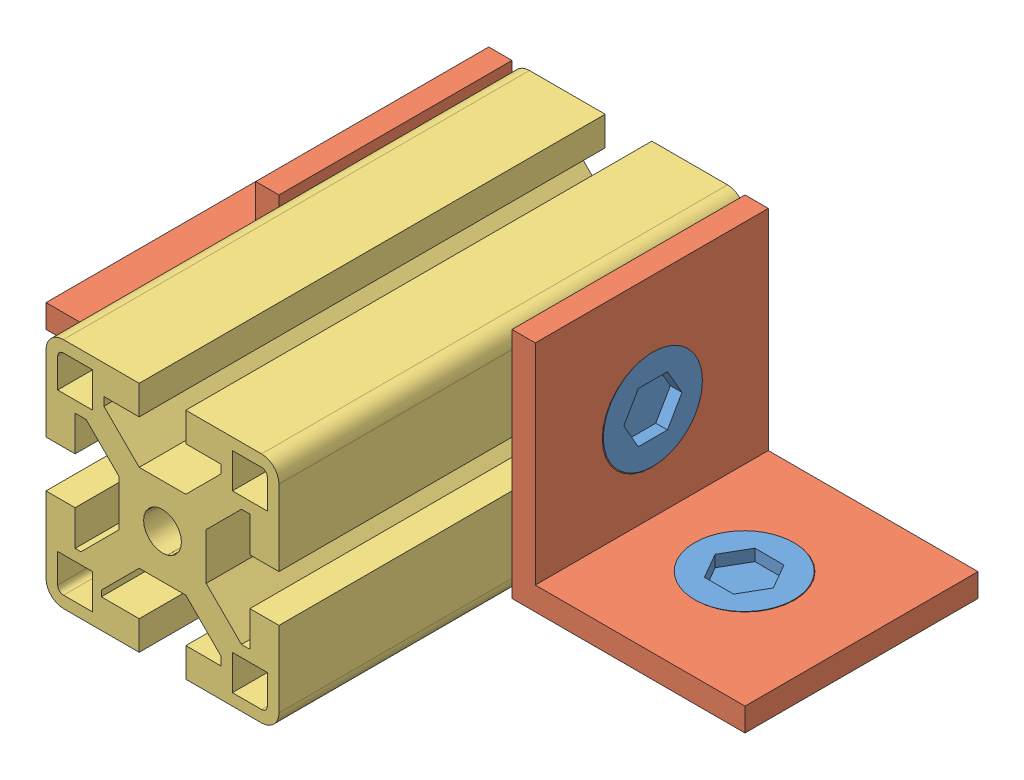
SolidWorks assembly X- Soporte motor.SLDASM, configuration Predeterminado (file format 3800). Lengths in mm.
Overall size (120 55.89 80).
9 component instances, 3 part files, 0 mates.
Components (placement in the parent):
- X-Angulo con tornillos-1: X-Angulo con tornillos.SLDASM [Predeterminado] at (20 -20 0) size (55.92 55.89 40)
  - X-Tornillos abellanados  M8 x16-1: X-Tornillos abellanados  M8 x16.SLDPRT [Predeterminado] at (19.9756 -15.8873 20.1118) size (17 20 17)
  - X-Angulo 40x40 L (0.0.196.87)-1: X-Angulo 40x40 L (0.0.196.87).SLDPRT [Predeterminado] at origin size (40 40 40)
  - X-Tornillos abellanados  M8 x16-2: X-Tornillos abellanados  M8 x16.SLDPRT [Predeterminado] at (-15.9177 20.1326 19.8969) x (0 0 1) z (0 1 0) size (17 20 17)
- X-Pervil AL estructura 4x4x80-2: X-Pervil AL estructura 4x4x80.SLDPRT [Predeterminado] at origin size (40 40 80)
- X-Angulo con tornillos-2: X-Angulo con tornillos.SLDASM [Predeterminado] at (-20 -20 40) x (-1 0 0) z (0 0 -1) size (55.92 55.89 40)
  - X-Tornillos abellanados  M8 x16-1: X-Tornillos abellanados  M8 x16.SLDPRT [Predeterminado] at (19.9756 -15.8873 20.1118) size (17 20 17)
  - X-Angulo 40x40 L (0.0.196.87)-1: X-Angulo 40x40 L (0.0.196.87).SLDPRT [Predeterminado] at origin size (40 40 40)
  - X-Tornillos abellanados  M8 x16-2: X-Tornillos abellanados  M8 x16.SLDPRT [Predeterminado] at (-15.9177 20.1326 19.8969) x (0 0 1) z (0 1 0) size (17 20 17)
